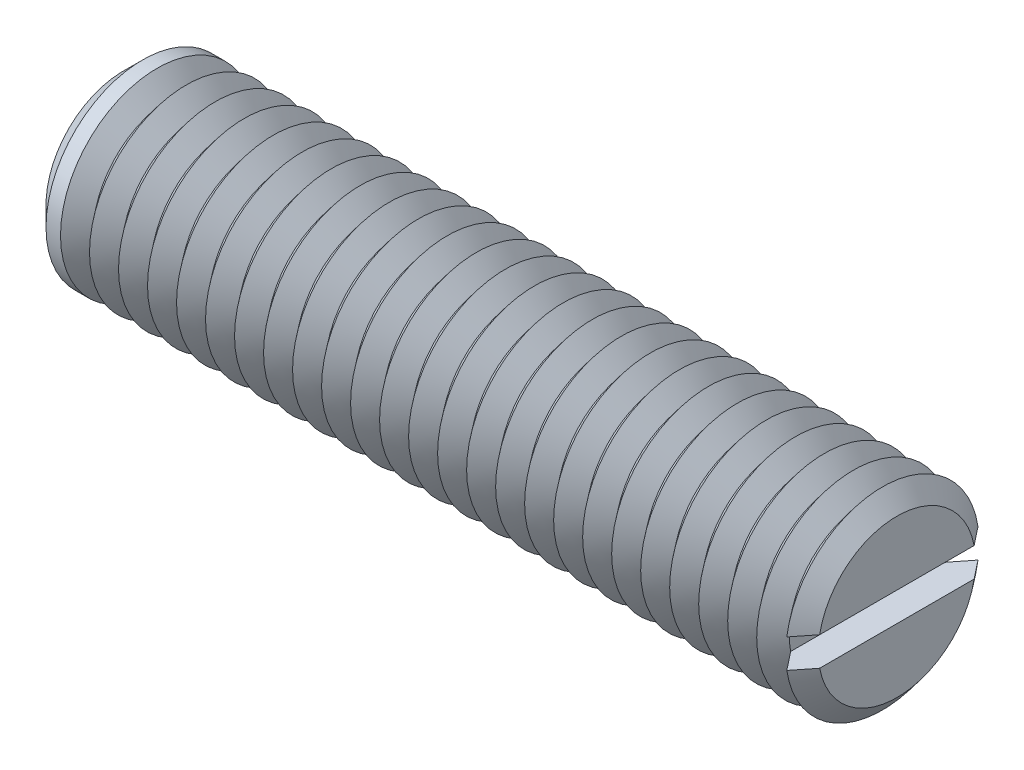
from build123d import *

# Parameters (mm, degrees)
SKETCH1_R       = 5
EXTRUDE1_DEPTH  = 20
SKETCH2_W       = 1.5
SKETCH2_H       = 1.5
EXTRUDE2_DEPTH  = 7.5
CHAMFER1_SIZE   = 1
LPATTERN1_COUNT = 26
LPATTERN1_PITCH = 1.5


with BuildPart() as part:
    # Sketch1 → Extrude1 (new, symmetric)
    with BuildSketch(Plane(origin=(0, 0, 0), x_dir=(0, 0, -1), z_dir=(1, 0, 0))):
        Circle(SKETCH1_R)
    extrude(amount=EXTRUDE1_DEPTH, both=True)

    # Sketch2 → Extrude2 (cut, symmetric)
    with BuildSketch(Plane.XY):
        with Locations((19.25, 0)):
            Rectangle(SKETCH2_W, SKETCH2_H)
    extrude(amount=EXTRUDE2_DEPTH, both=True, mode=Mode.SUBTRACT)

    # Chamfer1
    chamfer1_edges = [part.edges().sort_by_distance(p)[0] for p in [
        (-20, 0, 5),
    ]]
    chamfer(chamfer1_edges, length=CHAMFER1_SIZE)

    # Sketch3 → Cut-Revolve1 (revolve, cut)
    with BuildSketch(Plane.XY, mode=Mode.PRIVATE) as cut_revolve1_sk:
        Polygon((19.25, -5), (20.75, -5), (20, -4.0632503), align=None)
    cut_revolve1 = revolve(cut_revolve1_sk.sketch.rotate(Axis((0, 0, 0), (1, 0, 0)), 261.373073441), axis=Axis((0, 0, 0), (1, 0, 0)), mode=Mode.SUBTRACT)

    # LPattern1: Cut-Revolve1 ×26
    with Locations(*[(-i * LPATTERN1_PITCH, 0, 0) for i in range(1, LPATTERN1_COUNT)]):
        add(cut_revolve1, mode=Mode.SUBTRACT)


solid = part.part
